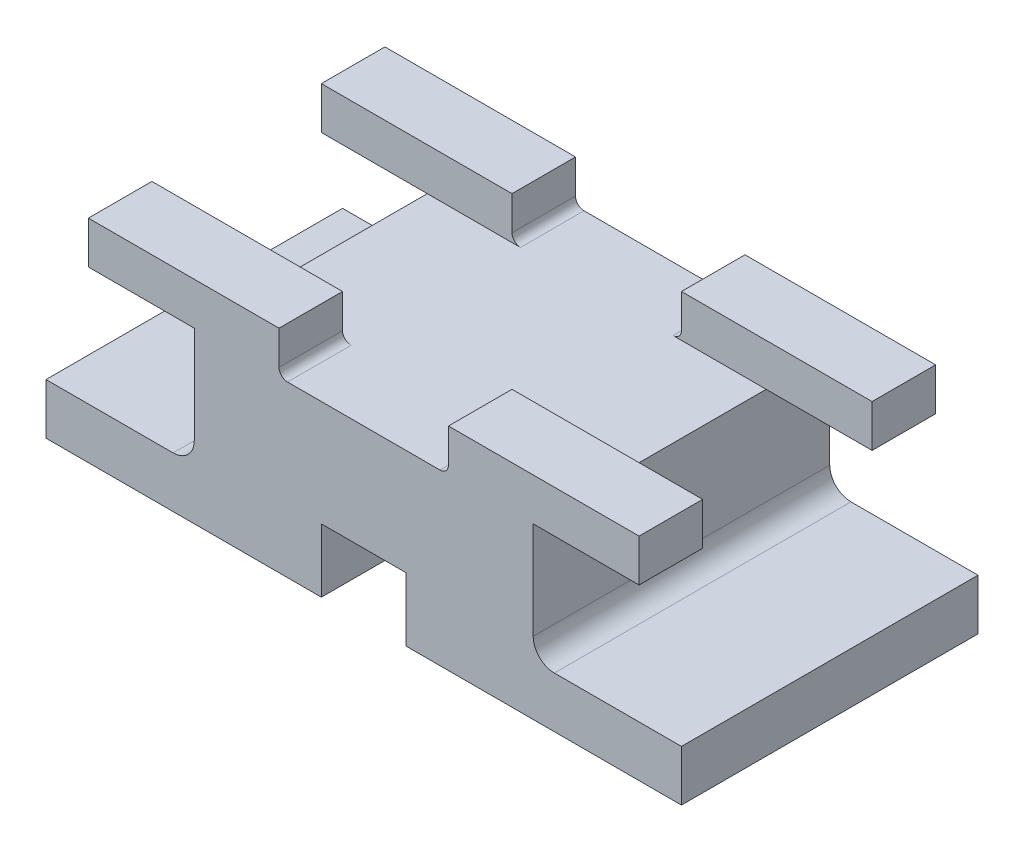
from build123d import *

# Parameters (mm, degrees)
AUFSATZ_LINEAR_AUSTRAGEN1_DEPTH = 35
SCHNITT_LINEAR_AUSTRAGEN1_REACH = 98.695
SKIZZE2_W                       = 130
SKIZZE2_H                       = 40


with BuildPart() as part:
    # Skizze1 → Aufsatz-Linear austragen1 (new, symmetric)
    with BuildSketch(Plane.XY):
        with BuildLine():
            Line((-75, 0), (-75, 12))
            Line((-75, 12), (-45, 12))
            ThreePointArc((-45, 12), (-41.464466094, 13.464466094), (-40, 17))
            Line((-40, 17), (-40, 40))
            Line((-40, 40), (-65, 40))
            Line((-65, 40), (-65, 50))
            Line((-65, 50), (-20, 50))
            Line((-20, 50), (-20, 42))
            ThreePointArc((-20, 42), (-19.414213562, 40.585786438), (-18, 40))
            Line((-18, 40), (18, 40))
            ThreePointArc((18, 40), (19.414213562, 40.585786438), (20, 42))
            Line((20, 42), (20, 50))
            Line((20, 50), (65, 50))
            Line((65, 50), (65, 40))
            Line((65, 40), (40, 40))
            Line((40, 40), (40, 17))
            ThreePointArc((40, 17), (41.464466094, 13.464466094), (45, 12))
            Line((45, 12), (75, 12))
            Line((75, 12), (75, 0))
            Line((75, 0), (10, 0))
            Line((10, 0), (10, 15))
            Line((10, 15), (-10, 15))
            Line((-10, 15), (-10, 0))
            Line((-10, 0), (-75, 0))
        make_face()
    extrude(amount=AUFSATZ_LINEAR_AUSTRAGEN1_DEPTH, both=True)

    # Schnitt-Linear austragen1: up to this face of the body (flat: up to its plane)
    schnitt_linear_austragen1_end = Plane(part.part.faces().sort_by_distance((-52.5, 40, 0))[0])
    # Skizze2 → Schnitt-Linear austragen1 (cut, up to the picked face)
    with BuildSketch(Plane(origin=(0, 50, 0), x_dir=(1, 0, 0), z_dir=(0, 1, 0)), mode=Mode.PRIVATE) as schnitt_linear_austragen1_sk1:
        Rectangle(SKIZZE2_W, SKIZZE2_H)
    schnitt_linear_austragen1_tool1 = split(extrude(schnitt_linear_austragen1_sk1.sketch, amount=-SCHNITT_LINEAR_AUSTRAGEN1_REACH, mode=Mode.PRIVATE), bisect_by=schnitt_linear_austragen1_end, keep=Keep.BOTH, mode=Mode.PRIVATE)
    add(schnitt_linear_austragen1_tool1.solids().sort_by(Axis((0, 50, 0), (0, -1, 0)))[0], mode=Mode.SUBTRACT)


solid = part.part
